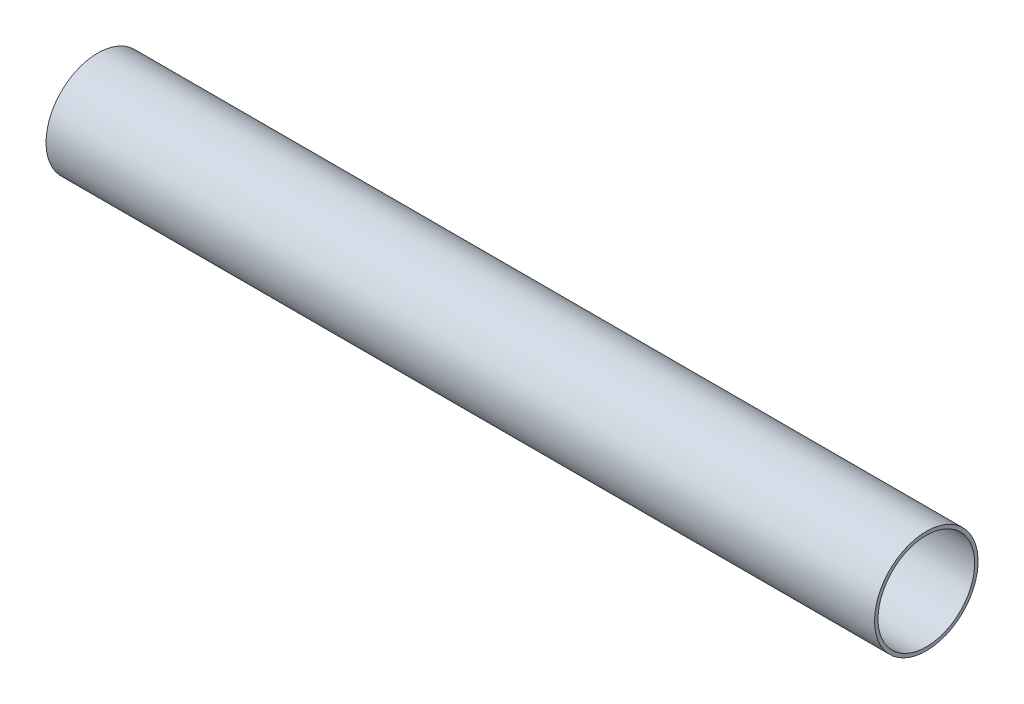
ISO-10303-21;
HEADER;
FILE_DESCRIPTION(('STEP AP214'),'2;1');
FILE_NAME('part.step','',(''),(''),'','','');
FILE_SCHEMA(('AUTOMOTIVE_DESIGN { 1 0 10303 214 1 1 1 1 }'));
ENDSEC;
DATA;
#1=APPLICATION_CONTEXT('core data for automotive mechanical design processes');
#2=APPLICATION_PROTOCOL_DEFINITION('international standard','automotive_design',2000,#1);
#3=PRODUCT_CONTEXT('',#1,'mechanical');
#4=PRODUCT('Part','Part','',(#3));
#5=PRODUCT_RELATED_PRODUCT_CATEGORY('part','',(#4));
#6=PRODUCT_DEFINITION_FORMATION('','',#4);
#7=PRODUCT_DEFINITION_CONTEXT('part definition',#1,'design');
#8=PRODUCT_DEFINITION('design','',#6,#7);
#9=PRODUCT_DEFINITION_SHAPE('','',#8);
#10=(LENGTH_UNIT() NAMED_UNIT(*) SI_UNIT(.MILLI.,.METRE.));
#11=(NAMED_UNIT(*) PLANE_ANGLE_UNIT() SI_UNIT($,.RADIAN.));
#12=(NAMED_UNIT(*) SI_UNIT($,.STERADIAN.) SOLID_ANGLE_UNIT());
#13=UNCERTAINTY_MEASURE_WITH_UNIT(LENGTH_MEASURE(1.E-05),#10,'distance_accuracy_value','');
#14=(GEOMETRIC_REPRESENTATION_CONTEXT(3) GLOBAL_UNCERTAINTY_ASSIGNED_CONTEXT((#13)) GLOBAL_UNIT_ASSIGNED_CONTEXT((#10,
#11,#12)) REPRESENTATION_CONTEXT('',''));
#15=CARTESIAN_POINT('',(0.,0.,0.));
#16=DIRECTION('',(0.,0.,1.));
#17=DIRECTION('',(1.,0.,0.));
#18=AXIS2_PLACEMENT_3D('',#15,#16,#17);
#19=CARTESIAN_POINT('',(304.8,0.,0.));
#20=DIRECTION('',(1.,0.,0.));
#21=DIRECTION('',(0.,0.,-1.));
#22=AXIS2_PLACEMENT_3D('',#19,#20,#21);
#23=PLANE('',#22);
#24=CARTESIAN_POINT('',(304.8,0.,0.));
#25=DIRECTION('',(1.,0.,0.));
#26=DIRECTION('',(0.,0.,-1.));
#27=AXIS2_PLACEMENT_3D('',#24,#25,#26);
#28=CIRCLE('',#27,19.05);
#29=CARTESIAN_POINT('',(304.8,0.,19.05));
#30=VERTEX_POINT('',#29);
#31=EDGE_CURVE('E10',#30,#30,#28,.T.);
#32=ORIENTED_EDGE('',*,*,#31,.T.);
#33=EDGE_LOOP('',(#32));
#34=FACE_BOUND('',#33,.T.);
#35=CARTESIAN_POINT('',(304.8,0.,0.));
#36=DIRECTION('',(1.,0.,0.));
#37=DIRECTION('',(0.,0.,-1.));
#38=AXIS2_PLACEMENT_3D('',#35,#36,#37);
#39=CIRCLE('',#38,17.78);
#40=CARTESIAN_POINT('',(304.8,0.,17.78));
#41=VERTEX_POINT('',#40);
#42=EDGE_CURVE('E42',#41,#41,#39,.T.);
#43=ORIENTED_EDGE('',*,*,#42,.F.);
#44=EDGE_LOOP('',(#43));
#45=FACE_BOUND('',#44,.T.);
#46=ADVANCED_FACE('F31',(#34,#45),#23,.T.);
#47=CARTESIAN_POINT('',(0.,0.,0.));
#48=DIRECTION('',(1.,0.,0.));
#49=DIRECTION('',(0.,0.,-1.));
#50=AXIS2_PLACEMENT_3D('',#47,#48,#49);
#51=PLANE('',#50);
#52=CARTESIAN_POINT('',(0.,0.,0.));
#53=DIRECTION('',(1.,0.,0.));
#54=DIRECTION('',(0.,0.,-1.));
#55=AXIS2_PLACEMENT_3D('',#52,#53,#54);
#56=CIRCLE('',#55,19.05);
#57=CARTESIAN_POINT('',(0.,0.,19.05));
#58=VERTEX_POINT('',#57);
#59=EDGE_CURVE('E35',#58,#58,#56,.T.);
#60=ORIENTED_EDGE('',*,*,#59,.F.);
#61=EDGE_LOOP('',(#60));
#62=FACE_BOUND('',#61,.T.);
#63=CARTESIAN_POINT('',(0.,0.,0.));
#64=DIRECTION('',(1.,0.,0.));
#65=DIRECTION('',(0.,0.,-1.));
#66=AXIS2_PLACEMENT_3D('',#63,#64,#65);
#67=CIRCLE('',#66,17.78);
#68=CARTESIAN_POINT('',(0.,0.,17.78));
#69=VERTEX_POINT('',#68);
#70=EDGE_CURVE('E44',#69,#69,#67,.T.);
#71=ORIENTED_EDGE('',*,*,#70,.T.);
#72=EDGE_LOOP('',(#71));
#73=FACE_BOUND('',#72,.T.);
#74=ADVANCED_FACE('F54',(#62,#73),#51,.F.);
#75=CARTESIAN_POINT('',(304.8,0.,0.));
#76=DIRECTION('',(-1.,0.,0.));
#77=DIRECTION('',(0.,0.,1.));
#78=AXIS2_PLACEMENT_3D('',#75,#76,#77);
#79=CYLINDRICAL_SURFACE('',#78,19.05);
#80=CARTESIAN_POINT('',(304.8,0.,19.05));
#81=CARTESIAN_POINT('',(301.625,0.,19.05));
#82=CARTESIAN_POINT('',(298.45,0.,19.05));
#83=CARTESIAN_POINT('',(292.1,0.,19.05));
#84=CARTESIAN_POINT('',(288.925,0.,19.05));
#85=CARTESIAN_POINT('',(282.575,0.,19.05));
#86=CARTESIAN_POINT('',(279.4,0.,19.05));
#87=CARTESIAN_POINT('',(273.05,0.,19.05));
#88=CARTESIAN_POINT('',(269.875,0.,19.05));
#89=CARTESIAN_POINT('',(263.525,0.,19.05));
#90=CARTESIAN_POINT('',(260.35,0.,19.05));
#91=CARTESIAN_POINT('',(254.,0.,19.05));
#92=CARTESIAN_POINT('',(250.825,0.,19.05));
#93=CARTESIAN_POINT('',(244.475,0.,19.05));
#94=CARTESIAN_POINT('',(241.3,0.,19.05));
#95=CARTESIAN_POINT('',(234.95,0.,19.05));
#96=CARTESIAN_POINT('',(231.775,0.,19.05));
#97=CARTESIAN_POINT('',(225.425,0.,19.05));
#98=CARTESIAN_POINT('',(222.25,0.,19.05));
#99=CARTESIAN_POINT('',(215.9,0.,19.05));
#100=CARTESIAN_POINT('',(212.725,0.,19.05));
#101=CARTESIAN_POINT('',(206.375,0.,19.05));
#102=CARTESIAN_POINT('',(203.2,0.,19.05));
#103=CARTESIAN_POINT('',(196.85,0.,19.05));
#104=CARTESIAN_POINT('',(193.675,0.,19.05));
#105=CARTESIAN_POINT('',(187.325,0.,19.05));
#106=CARTESIAN_POINT('',(184.15,0.,19.05));
#107=CARTESIAN_POINT('',(177.8,0.,19.05));
#108=CARTESIAN_POINT('',(174.625,0.,19.05));
#109=CARTESIAN_POINT('',(168.275,0.,19.05));
#110=CARTESIAN_POINT('',(165.1,0.,19.05));
#111=CARTESIAN_POINT('',(158.75,0.,19.05));
#112=CARTESIAN_POINT('',(155.575,0.,19.05));
#113=CARTESIAN_POINT('',(149.225,0.,19.05));
#114=CARTESIAN_POINT('',(146.05,0.,19.05));
#115=CARTESIAN_POINT('',(139.7,0.,19.05));
#116=CARTESIAN_POINT('',(136.525,0.,19.05));
#117=CARTESIAN_POINT('',(130.175,0.,19.05));
#118=CARTESIAN_POINT('',(127.,0.,19.05));
#119=CARTESIAN_POINT('',(120.65,0.,19.05));
#120=CARTESIAN_POINT('',(117.475,0.,19.05));
#121=CARTESIAN_POINT('',(111.125,0.,19.05));
#122=CARTESIAN_POINT('',(107.95,0.,19.05));
#123=CARTESIAN_POINT('',(101.6,0.,19.05));
#124=CARTESIAN_POINT('',(98.425,0.,19.05));
#125=CARTESIAN_POINT('',(92.075,0.,19.05));
#126=CARTESIAN_POINT('',(88.9,0.,19.05));
#127=CARTESIAN_POINT('',(82.55,0.,19.05));
#128=CARTESIAN_POINT('',(79.375,0.,19.05));
#129=CARTESIAN_POINT('',(73.025,0.,19.05));
#130=CARTESIAN_POINT('',(69.85,0.,19.05));
#131=CARTESIAN_POINT('',(63.5,0.,19.05));
#132=CARTESIAN_POINT('',(60.325,0.,19.05));
#133=CARTESIAN_POINT('',(53.975,0.,19.05));
#134=CARTESIAN_POINT('',(50.8,0.,19.05));
#135=CARTESIAN_POINT('',(44.45,0.,19.05));
#136=CARTESIAN_POINT('',(41.275,0.,19.05));
#137=CARTESIAN_POINT('',(34.925,0.,19.05));
#138=CARTESIAN_POINT('',(31.75,0.,19.05));
#139=CARTESIAN_POINT('',(25.4,0.,19.05));
#140=CARTESIAN_POINT('',(22.225,0.,19.05));
#141=CARTESIAN_POINT('',(15.875,0.,19.05));
#142=CARTESIAN_POINT('',(12.7,0.,19.05));
#143=CARTESIAN_POINT('',(6.35,0.,19.05));
#144=CARTESIAN_POINT('',(3.175,0.,19.05));
#145=CARTESIAN_POINT('',(0.,0.,19.05));
#146=B_SPLINE_CURVE_WITH_KNOTS('',3,(#80,#81,#82,#83,#84,#85,#86,#87,#88,#89,#90,#91,#92,#93,
#94,#95,#96,#97,#98,#99,#100,#101,#102,#103,#104,#105,#106,#107,#108,#109,#110,#111,#112,#113,
#114,#115,#116,#117,#118,#119,#120,#121,#122,#123,#124,#125,#126,#127,#128,#129,#130,#131,#132,
#133,#134,#135,#136,#137,#138,#139,#140,#141,#142,#143,#144,#145),.UNSPECIFIED.,.F.,.F.,(4,2,2,
2,2,2,2,2,2,2,2,2,2,2,2,2,2,2,2,2,2,2,2,2,2,2,2,2,2,2,2,2,4),(0.,9.52500000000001,19.05,28.575,
38.1,47.625,57.15,66.675,76.2,85.7250000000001,95.2500000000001,104.775,114.3,123.825,133.35,
142.875,152.4,161.925,171.45,180.975,190.5,200.025,209.55,219.075,228.6,238.125,247.65,257.175,
266.7,276.225,285.75,295.275,304.8),.UNSPECIFIED.);
#147=EDGE_CURVE('BSEAM33',#30,#58,#146,.T.);
#148=ORIENTED_EDGE('',*,*,#31,.F.);
#149=ORIENTED_EDGE('',*,*,#59,.T.);
#150=ORIENTED_EDGE('',*,*,#147,.T.);
#151=ORIENTED_EDGE('',*,*,#147,.F.);
#152=EDGE_LOOP('',(#148,#150,#149,#151));
#153=FACE_BOUND('',#152,.T.);
#154=ADVANCED_FACE('F33',(#153),#79,.T.);
#155=CARTESIAN_POINT('',(304.8,0.,0.));
#156=DIRECTION('',(-1.,0.,0.));
#157=DIRECTION('',(0.,0.,1.));
#158=AXIS2_PLACEMENT_3D('',#155,#156,#157);
#159=CYLINDRICAL_SURFACE('',#158,17.78);
#160=CARTESIAN_POINT('',(304.8,0.,17.78));
#161=CARTESIAN_POINT('',(301.625,0.,17.78));
#162=CARTESIAN_POINT('',(298.45,0.,17.78));
#163=CARTESIAN_POINT('',(292.1,0.,17.78));
#164=CARTESIAN_POINT('',(288.925,0.,17.78));
#165=CARTESIAN_POINT('',(282.575,0.,17.78));
#166=CARTESIAN_POINT('',(279.4,0.,17.78));
#167=CARTESIAN_POINT('',(273.05,0.,17.78));
#168=CARTESIAN_POINT('',(269.875,0.,17.78));
#169=CARTESIAN_POINT('',(263.525,0.,17.78));
#170=CARTESIAN_POINT('',(260.35,0.,17.78));
#171=CARTESIAN_POINT('',(254.,0.,17.78));
#172=CARTESIAN_POINT('',(250.825,0.,17.78));
#173=CARTESIAN_POINT('',(244.475,0.,17.78));
#174=CARTESIAN_POINT('',(241.3,0.,17.78));
#175=CARTESIAN_POINT('',(234.95,0.,17.78));
#176=CARTESIAN_POINT('',(231.775,0.,17.78));
#177=CARTESIAN_POINT('',(225.425,0.,17.78));
#178=CARTESIAN_POINT('',(222.25,0.,17.78));
#179=CARTESIAN_POINT('',(215.9,0.,17.78));
#180=CARTESIAN_POINT('',(212.725,0.,17.78));
#181=CARTESIAN_POINT('',(206.375,0.,17.78));
#182=CARTESIAN_POINT('',(203.2,0.,17.78));
#183=CARTESIAN_POINT('',(196.85,0.,17.78));
#184=CARTESIAN_POINT('',(193.675,0.,17.78));
#185=CARTESIAN_POINT('',(187.325,0.,17.78));
#186=CARTESIAN_POINT('',(184.15,0.,17.78));
#187=CARTESIAN_POINT('',(177.8,0.,17.78));
#188=CARTESIAN_POINT('',(174.625,0.,17.78));
#189=CARTESIAN_POINT('',(168.275,0.,17.78));
#190=CARTESIAN_POINT('',(165.1,0.,17.78));
#191=CARTESIAN_POINT('',(158.75,0.,17.78));
#192=CARTESIAN_POINT('',(155.575,0.,17.78));
#193=CARTESIAN_POINT('',(149.225,0.,17.78));
#194=CARTESIAN_POINT('',(146.05,0.,17.78));
#195=CARTESIAN_POINT('',(139.7,0.,17.78));
#196=CARTESIAN_POINT('',(136.525,0.,17.78));
#197=CARTESIAN_POINT('',(130.175,0.,17.78));
#198=CARTESIAN_POINT('',(127.,0.,17.78));
#199=CARTESIAN_POINT('',(120.65,0.,17.78));
#200=CARTESIAN_POINT('',(117.475,0.,17.78));
#201=CARTESIAN_POINT('',(111.125,0.,17.78));
#202=CARTESIAN_POINT('',(107.95,0.,17.78));
#203=CARTESIAN_POINT('',(101.6,0.,17.78));
#204=CARTESIAN_POINT('',(98.425,0.,17.78));
#205=CARTESIAN_POINT('',(92.075,0.,17.78));
#206=CARTESIAN_POINT('',(88.9,0.,17.78));
#207=CARTESIAN_POINT('',(82.55,0.,17.78));
#208=CARTESIAN_POINT('',(79.375,0.,17.78));
#209=CARTESIAN_POINT('',(73.025,0.,17.78));
#210=CARTESIAN_POINT('',(69.85,0.,17.78));
#211=CARTESIAN_POINT('',(63.5,0.,17.78));
#212=CARTESIAN_POINT('',(60.325,0.,17.78));
#213=CARTESIAN_POINT('',(53.975,0.,17.78));
#214=CARTESIAN_POINT('',(50.8,0.,17.78));
#215=CARTESIAN_POINT('',(44.45,0.,17.78));
#216=CARTESIAN_POINT('',(41.275,0.,17.78));
#217=CARTESIAN_POINT('',(34.925,0.,17.78));
#218=CARTESIAN_POINT('',(31.75,0.,17.78));
#219=CARTESIAN_POINT('',(25.4,0.,17.78));
#220=CARTESIAN_POINT('',(22.225,0.,17.78));
#221=CARTESIAN_POINT('',(15.875,0.,17.78));
#222=CARTESIAN_POINT('',(12.7,0.,17.78));
#223=CARTESIAN_POINT('',(6.35,0.,17.78));
#224=CARTESIAN_POINT('',(3.175,0.,17.78));
#225=CARTESIAN_POINT('',(0.,0.,17.78));
#226=B_SPLINE_CURVE_WITH_KNOTS('',3,(#160,#161,#162,#163,#164,#165,#166,#167,#168,#169,#170,
#171,#172,#173,#174,#175,#176,#177,#178,#179,#180,#181,#182,#183,#184,#185,#186,#187,#188,#189,
#190,#191,#192,#193,#194,#195,#196,#197,#198,#199,#200,#201,#202,#203,#204,#205,#206,#207,#208,
#209,#210,#211,#212,#213,#214,#215,#216,#217,#218,#219,#220,#221,#222,#223,#224,#225),
.UNSPECIFIED.,.F.,.F.,(4,2,2,2,2,2,2,2,2,2,2,2,2,2,2,2,2,2,2,2,2,2,2,2,2,2,2,2,2,2,2,2,4),(0.,
9.52500000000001,19.05,28.575,38.1,47.625,57.15,66.675,76.2,85.7250000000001,95.2500000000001,
104.775,114.3,123.825,133.35,142.875,152.4,161.925,171.45,180.975,190.5,200.025,209.55,219.075,
228.6,238.125,247.65,257.175,266.7,276.225,285.75,295.275,304.8),.UNSPECIFIED.);
#227=EDGE_CURVE('BSEAM50',#41,#69,#226,.T.);
#228=ORIENTED_EDGE('',*,*,#42,.T.);
#229=ORIENTED_EDGE('',*,*,#70,.F.);
#230=ORIENTED_EDGE('',*,*,#227,.T.);
#231=ORIENTED_EDGE('',*,*,#227,.F.);
#232=EDGE_LOOP('',(#228,#230,#229,#231));
#233=FACE_BOUND('',#232,.T.);
#234=ADVANCED_FACE('F50',(#233),#159,.F.);
#235=CLOSED_SHELL('',(#46,#74,#154,#234));
#236=MANIFOLD_SOLID_BREP('B2',#235);
#237=ADVANCED_BREP_SHAPE_REPRESENTATION('',(#18,#236),#14);
#238=SHAPE_DEFINITION_REPRESENTATION(#9,#237);
ENDSEC;
END-ISO-10303-21;
